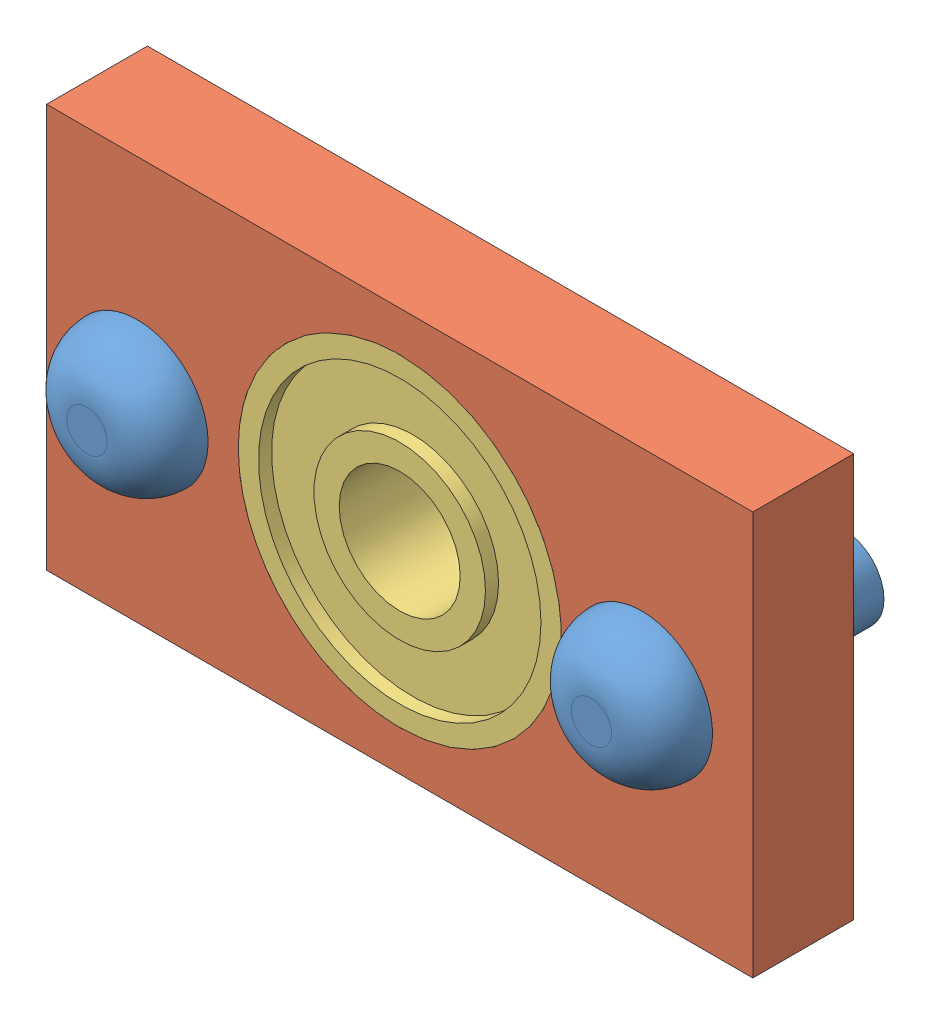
SolidWorks assembly Y-Rodamiento con soporte y tornillo.SLDASM, configuration Predeterminado (file format 3800). Lengths in mm.
Overall size (70 40 25).
5 component instances, 3 part files, 0 mates.
Components (placement in the parent):
- Y-Tornillo M8 x20-2: Y-Tornillo M8 x20.SLDPRT [Predeterminado] at (-25 0 5.5) x (-1 0 0) z (0 0 -1) size (14 14 25)
- Y-Tornillo M8 x20-1: Y-Tornillo M8 x20.SLDPRT [Predeterminado] at (25 0 5.5) x (-1 0 0) z (0 0 -1) size (14 14 25)
- Y-Rodamiento con soporte-1: Y-Rodamiento con soporte.SLDASM [Predeterminado] at (0 0 -10.5) size (70 40 10)
  - Y-Soporte rodamiento-1: Y-Soporte rodamiento.SLDPRT [Predeterminado] at origin size (70 40 10)
  - Y-Rodamiento (7201.2RS.TVP)-1: Y-Rodamiento (7201.2RS.TVP).SLDPRT [Predeterminado] at origin size (32 32 10)
